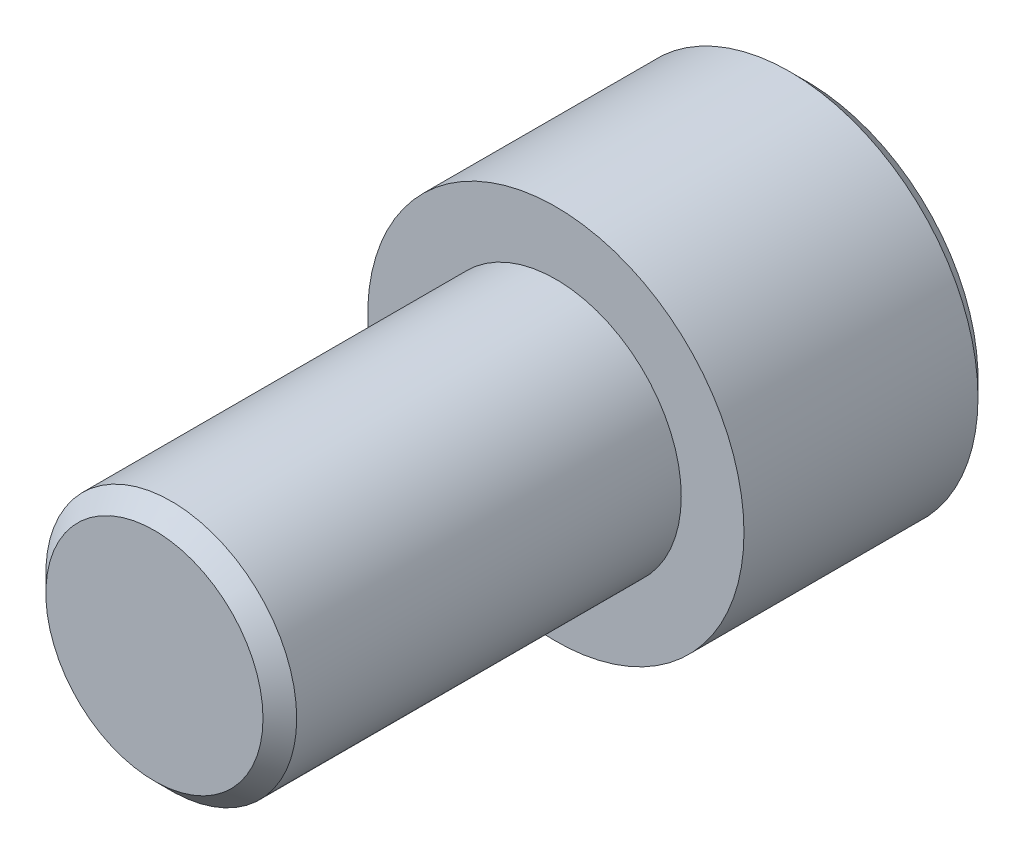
ISO-10303-21;
HEADER;
FILE_DESCRIPTION(('STEP AP214'),'2;1');
FILE_NAME('part.step','',(''),(''),'','','');
FILE_SCHEMA(('AUTOMOTIVE_DESIGN { 1 0 10303 214 1 1 1 1 }'));
ENDSEC;
DATA;
#1=APPLICATION_CONTEXT('core data for automotive mechanical design processes');
#2=APPLICATION_PROTOCOL_DEFINITION('international standard','automotive_design',2000,#1);
#3=PRODUCT_CONTEXT('',#1,'mechanical');
#4=PRODUCT('Part','Part','',(#3));
#5=PRODUCT_RELATED_PRODUCT_CATEGORY('part','',(#4));
#6=PRODUCT_DEFINITION_FORMATION('','',#4);
#7=PRODUCT_DEFINITION_CONTEXT('part definition',#1,'design');
#8=PRODUCT_DEFINITION('design','',#6,#7);
#9=PRODUCT_DEFINITION_SHAPE('','',#8);
#10=(LENGTH_UNIT() NAMED_UNIT(*) SI_UNIT(.MILLI.,.METRE.));
#11=(NAMED_UNIT(*) PLANE_ANGLE_UNIT() SI_UNIT($,.RADIAN.));
#12=(NAMED_UNIT(*) SI_UNIT($,.STERADIAN.) SOLID_ANGLE_UNIT());
#13=UNCERTAINTY_MEASURE_WITH_UNIT(LENGTH_MEASURE(1.E-05),#10,'distance_accuracy_value','');
#14=(GEOMETRIC_REPRESENTATION_CONTEXT(3) GLOBAL_UNCERTAINTY_ASSIGNED_CONTEXT((#13)) GLOBAL_UNIT_ASSIGNED_CONTEXT((#10,
#11,#12)) REPRESENTATION_CONTEXT('',''));
#15=CARTESIAN_POINT('',(0.,0.,0.));
#16=DIRECTION('',(0.,0.,1.));
#17=DIRECTION('',(1.,0.,0.));
#18=AXIS2_PLACEMENT_3D('',#15,#16,#17);
#19=CARTESIAN_POINT('',(0.,0.,12.7));
#20=DIRECTION('',(0.,0.,1.));
#21=DIRECTION('',(1.,0.,0.));
#22=AXIS2_PLACEMENT_3D('',#19,#20,#21);
#23=PLANE('',#22);
#24=CARTESIAN_POINT('',(0.,0.,12.7));
#25=DIRECTION('',(0.,0.,1.));
#26=DIRECTION('',(1.,0.,0.));
#27=AXIS2_PLACEMENT_3D('',#24,#25,#26);
#28=CIRCLE('',#27,3.43535);
#29=CARTESIAN_POINT('',(3.43535,0.,12.7));
#30=VERTEX_POINT('',#29);
#31=EDGE_CURVE('E40',#30,#30,#28,.T.);
#32=ORIENTED_EDGE('',*,*,#31,.T.);
#33=EDGE_LOOP('',(#32));
#34=FACE_BOUND('',#33,.T.);
#35=ADVANCED_FACE('F32',(#34),#23,.T.);
#36=CARTESIAN_POINT('',(0.,0.,12.7));
#37=DIRECTION('',(0.,0.,1.));
#38=DIRECTION('',(1.,0.,0.));
#39=AXIS2_PLACEMENT_3D('',#36,#37,#38);
#40=CYLINDRICAL_SURFACE('',#39,3.96875);
#41=CARTESIAN_POINT('',(0.,0.,12.1666));
#42=DIRECTION('',(0.,0.,1.));
#43=DIRECTION('',(1.,0.,0.));
#44=AXIS2_PLACEMENT_3D('',#41,#42,#43);
#45=CIRCLE('',#44,3.96875);
#46=CARTESIAN_POINT('',(3.96875,0.,12.1666));
#47=VERTEX_POINT('',#46);
#48=EDGE_CURVE('E11',#47,#47,#45,.F.);
#49=ORIENTED_EDGE('',*,*,#48,.T.);
#50=EDGE_LOOP('',(#49));
#51=FACE_BOUND('',#50,.T.);
#52=CARTESIAN_POINT('',(0.,0.,0.));
#53=DIRECTION('',(0.,0.,1.));
#54=DIRECTION('',(1.,0.,0.));
#55=AXIS2_PLACEMENT_3D('',#52,#53,#54);
#56=CIRCLE('',#55,3.96875);
#57=CARTESIAN_POINT('',(3.96875,0.,0.));
#58=VERTEX_POINT('',#57);
#59=EDGE_CURVE('E142',#58,#58,#56,.T.);
#60=ORIENTED_EDGE('',*,*,#59,.T.);
#61=EDGE_LOOP('',(#60));
#62=FACE_BOUND('',#61,.T.);
#63=ADVANCED_FACE('F163',(#51,#62),#40,.T.);
#64=CARTESIAN_POINT('',(3.96875,0.,0.));
#65=DIRECTION('',(0.,0.,1.));
#66=DIRECTION('',(1.,0.,0.));
#67=AXIS2_PLACEMENT_3D('',#64,#65,#66);
#68=PLANE('',#67);
#69=CARTESIAN_POINT('',(0.,0.,0.));
#70=DIRECTION('',(0.,0.,1.));
#71=DIRECTION('',(1.,0.,0.));
#72=AXIS2_PLACEMENT_3D('',#69,#70,#71);
#73=CIRCLE('',#72,5.953125);
#74=CARTESIAN_POINT('',(5.953125,0.,0.));
#75=VERTEX_POINT('',#74);
#76=EDGE_CURVE('E134',#75,#75,#73,.T.);
#77=ORIENTED_EDGE('',*,*,#76,.T.);
#78=EDGE_LOOP('',(#77));
#79=FACE_BOUND('',#78,.T.);
#80=ORIENTED_EDGE('',*,*,#59,.F.);
#81=EDGE_LOOP('',(#80));
#82=FACE_BOUND('',#81,.T.);
#83=ADVANCED_FACE('F168',(#79,#82),#68,.T.);
#84=CARTESIAN_POINT('',(0.,0.,12.7));
#85=DIRECTION('',(0.,0.,1.));
#86=DIRECTION('',(1.,0.,0.));
#87=AXIS2_PLACEMENT_3D('',#84,#85,#86);
#88=CYLINDRICAL_SURFACE('',#87,5.953125);
#89=CARTESIAN_POINT('',(0.,0.,-7.4041));
#90=DIRECTION('',(0.,0.,-1.));
#91=DIRECTION('',(-1.,0.,0.));
#92=AXIS2_PLACEMENT_3D('',#89,#90,#91);
#93=CIRCLE('',#92,5.953125);
#94=CARTESIAN_POINT('',(-5.953125,0.,-7.4041));
#95=VERTEX_POINT('',#94);
#96=EDGE_CURVE('E145',#95,#95,#93,.F.);
#97=ORIENTED_EDGE('',*,*,#96,.T.);
#98=EDGE_LOOP('',(#97));
#99=FACE_BOUND('',#98,.T.);
#100=ORIENTED_EDGE('',*,*,#76,.F.);
#101=EDGE_LOOP('',(#100));
#102=FACE_BOUND('',#101,.T.);
#103=ADVANCED_FACE('F174',(#99,#102),#88,.T.);
#104=CARTESIAN_POINT('',(5.953125,0.,-7.9375));
#105=DIRECTION('',(0.,0.,-1.));
#106=DIRECTION('',(-1.,0.,0.));
#107=AXIS2_PLACEMENT_3D('',#104,#105,#106);
#108=PLANE('',#107);
#109=CARTESIAN_POINT('',(0.,0.,-7.9375));
#110=DIRECTION('',(0.,0.,-1.));
#111=DIRECTION('',(-1.,0.,0.));
#112=AXIS2_PLACEMENT_3D('',#109,#110,#111);
#113=CIRCLE('',#112,5.419725);
#114=CARTESIAN_POINT('',(-5.41972499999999,0.,-7.9375));
#115=VERTEX_POINT('',#114);
#116=EDGE_CURVE('E148',#115,#115,#113,.T.);
#117=ORIENTED_EDGE('',*,*,#116,.T.);
#118=EDGE_LOOP('',(#117));
#119=FACE_BOUND('',#118,.T.);
#120=DIRECTION('',(0.00412520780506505,-0.999991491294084,0.));
#121=VECTOR('',#120,1.);
#122=CARTESIAN_POINT('',(3.16741111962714,1.84616904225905,-7.9375));
#123=LINE('',#122,#121);
#124=CARTESIAN_POINT('',(3.16741111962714,1.84616904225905,-7.9375));
#125=VERTEX_POINT('',#124);
#126=CARTESIAN_POINT('',(3.1825348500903,-1.81997397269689,-7.9375));
#127=VERTEX_POINT('',#126);
#128=EDGE_CURVE('E47',#125,#127,#123,.T.);
#129=ORIENTED_EDGE('',*,*,#128,.F.);
#130=DIRECTION('',(0.868080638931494,-0.496423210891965,0.));
#131=VECTOR('',#130,1.);
#132=CARTESIAN_POINT('',(-0.0151237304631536,3.66614301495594,-7.9375));
#133=LINE('',#132,#131);
#134=CARTESIAN_POINT('',(-0.0151237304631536,3.66614301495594,-7.9375));
#135=VERTEX_POINT('',#134);
#136=EDGE_CURVE('E130',#135,#125,#133,.T.);
#137=ORIENTED_EDGE('',*,*,#136,.F.);
#138=DIRECTION('',(0.863955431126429,0.503568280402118,0.));
#139=VECTOR('',#138,1.);
#140=CARTESIAN_POINT('',(-3.18253485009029,1.81997397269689,-7.9375));
#141=LINE('',#140,#139);
#142=CARTESIAN_POINT('',(-3.18253485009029,1.81997397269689,-7.9375));
#143=VERTEX_POINT('',#142);
#144=EDGE_CURVE('E128',#143,#135,#141,.T.);
#145=ORIENTED_EDGE('',*,*,#144,.F.);
#146=DIRECTION('',(-0.00412520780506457,0.999991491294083,0.));
#147=VECTOR('',#146,1.);
#148=CARTESIAN_POINT('',(-3.16741111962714,-1.84616904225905,-7.9375));
#149=LINE('',#148,#147);
#150=CARTESIAN_POINT('',(-3.16741111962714,-1.84616904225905,-7.9375));
#151=VERTEX_POINT('',#150);
#152=EDGE_CURVE('E95',#151,#143,#149,.T.);
#153=ORIENTED_EDGE('',*,*,#152,.F.);
#154=DIRECTION('',(-0.868080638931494,0.496423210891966,0.));
#155=VECTOR('',#154,1.);
#156=CARTESIAN_POINT('',(0.015123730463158,-3.66614301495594,-7.9375));
#157=LINE('',#156,#155);
#158=CARTESIAN_POINT('',(0.015123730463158,-3.66614301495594,-7.9375));
#159=VERTEX_POINT('',#158);
#160=EDGE_CURVE('E124',#159,#151,#157,.T.);
#161=ORIENTED_EDGE('',*,*,#160,.F.);
#162=DIRECTION('',(-0.863955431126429,-0.503568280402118,0.));
#163=VECTOR('',#162,1.);
#164=CARTESIAN_POINT('',(3.1825348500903,-1.81997397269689,-7.9375));
#165=LINE('',#164,#163);
#166=EDGE_CURVE('E121',#127,#159,#165,.T.);
#167=ORIENTED_EDGE('',*,*,#166,.F.);
#168=EDGE_LOOP('',(#129,#137,#145,#153,#161,#167));
#169=FACE_BOUND('',#168,.T.);
#170=ADVANCED_FACE('F178',(#119,#169),#108,.T.);
#171=CARTESIAN_POINT('',(3.16741111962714,1.84616904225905,-1.5875));
#172=DIRECTION('',(0.999991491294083,0.00412520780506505,0.));
#173=DIRECTION('',(-0.00412520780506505,0.999991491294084,0.));
#174=AXIS2_PLACEMENT_3D('',#171,#172,#173);
#175=PLANE('',#174);
#176=ORIENTED_EDGE('',*,*,#128,.T.);
#177=DIRECTION('',(0.,0.,-1.));
#178=VECTOR('',#177,1.);
#179=CARTESIAN_POINT('',(3.1825348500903,-1.81997397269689,-1.5875));
#180=LINE('',#179,#178);
#181=CARTESIAN_POINT('',(3.1825348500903,-1.81997397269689,-1.5875));
#182=VERTEX_POINT('',#181);
#183=EDGE_CURVE('E77',#182,#127,#180,.T.);
#184=ORIENTED_EDGE('',*,*,#183,.F.);
#185=DIRECTION('',(0.00412520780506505,-0.999991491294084,0.));
#186=VECTOR('',#185,1.);
#187=CARTESIAN_POINT('',(3.16741111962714,1.84616904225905,-1.5875));
#188=LINE('',#187,#186);
#189=CARTESIAN_POINT('',(3.16741111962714,1.84616904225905,-1.5875));
#190=VERTEX_POINT('',#189);
#191=EDGE_CURVE('E132',#190,#182,#188,.T.);
#192=ORIENTED_EDGE('',*,*,#191,.F.);
#193=DIRECTION('',(0.,0.,-1.));
#194=VECTOR('',#193,1.);
#195=CARTESIAN_POINT('',(3.16741111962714,1.84616904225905,-1.5875));
#196=LINE('',#195,#194);
#197=EDGE_CURVE('E55',#190,#125,#196,.T.);
#198=ORIENTED_EDGE('',*,*,#197,.T.);
#199=EDGE_LOOP('',(#176,#184,#192,#198));
#200=FACE_BOUND('',#199,.T.);
#201=ADVANCED_FACE('F182',(#200),#175,.F.);
#202=CARTESIAN_POINT('',(-0.0151237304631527,3.66614301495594,-1.5875));
#203=DIRECTION('',(0.496423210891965,0.868080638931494,0.));
#204=DIRECTION('',(-0.868080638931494,0.496423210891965,0.));
#205=AXIS2_PLACEMENT_3D('',#202,#203,#204);
#206=PLANE('',#205);
#207=ORIENTED_EDGE('',*,*,#136,.T.);
#208=ORIENTED_EDGE('',*,*,#197,.F.);
#209=DIRECTION('',(0.868080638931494,-0.496423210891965,0.));
#210=VECTOR('',#209,1.);
#211=CARTESIAN_POINT('',(-0.0151237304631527,3.66614301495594,-1.5875));
#212=LINE('',#211,#210);
#213=CARTESIAN_POINT('',(-0.0151237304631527,3.66614301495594,-1.5875));
#214=VERTEX_POINT('',#213);
#215=EDGE_CURVE('E107',#214,#190,#212,.T.);
#216=ORIENTED_EDGE('',*,*,#215,.F.);
#217=DIRECTION('',(0.,0.,-1.));
#218=VECTOR('',#217,1.);
#219=CARTESIAN_POINT('',(-0.0151237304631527,3.66614301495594,-1.5875));
#220=LINE('',#219,#218);
#221=EDGE_CURVE('E99',#214,#135,#220,.T.);
#222=ORIENTED_EDGE('',*,*,#221,.T.);
#223=EDGE_LOOP('',(#207,#208,#216,#222));
#224=FACE_BOUND('',#223,.T.);
#225=ADVANCED_FACE('F186',(#224),#206,.F.);
#226=CARTESIAN_POINT('',(-3.18253485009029,1.81997397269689,-1.5875));
#227=DIRECTION('',(-0.503568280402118,0.863955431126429,0.));
#228=DIRECTION('',(-0.863955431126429,-0.503568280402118,0.));
#229=AXIS2_PLACEMENT_3D('',#226,#227,#228);
#230=PLANE('',#229);
#231=ORIENTED_EDGE('',*,*,#144,.T.);
#232=ORIENTED_EDGE('',*,*,#221,.F.);
#233=DIRECTION('',(0.863955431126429,0.503568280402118,0.));
#234=VECTOR('',#233,1.);
#235=CARTESIAN_POINT('',(-3.18253485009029,1.81997397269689,-1.5875));
#236=LINE('',#235,#234);
#237=CARTESIAN_POINT('',(-3.18253485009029,1.81997397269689,-1.5875));
#238=VERTEX_POINT('',#237);
#239=EDGE_CURVE('E103',#238,#214,#236,.T.);
#240=ORIENTED_EDGE('',*,*,#239,.F.);
#241=DIRECTION('',(0.,0.,-1.));
#242=VECTOR('',#241,1.);
#243=CARTESIAN_POINT('',(-3.18253485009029,1.81997397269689,-1.5875));
#244=LINE('',#243,#242);
#245=EDGE_CURVE('E88',#238,#143,#244,.T.);
#246=ORIENTED_EDGE('',*,*,#245,.T.);
#247=EDGE_LOOP('',(#231,#232,#240,#246));
#248=FACE_BOUND('',#247,.T.);
#249=ADVANCED_FACE('F104',(#248),#230,.F.);
#250=CARTESIAN_POINT('',(-3.16741111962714,-1.84616904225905,-1.5875));
#251=DIRECTION('',(-0.999991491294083,-0.00412520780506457,0.));
#252=DIRECTION('',(0.00412520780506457,-0.999991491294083,0.));
#253=AXIS2_PLACEMENT_3D('',#250,#251,#252);
#254=PLANE('',#253);
#255=ORIENTED_EDGE('',*,*,#152,.T.);
#256=ORIENTED_EDGE('',*,*,#245,.F.);
#257=DIRECTION('',(-0.00412520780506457,0.999991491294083,0.));
#258=VECTOR('',#257,1.);
#259=CARTESIAN_POINT('',(-3.16741111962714,-1.84616904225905,-1.5875));
#260=LINE('',#259,#258);
#261=CARTESIAN_POINT('',(-3.16741111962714,-1.84616904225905,-1.5875));
#262=VERTEX_POINT('',#261);
#263=EDGE_CURVE('E92',#262,#238,#260,.T.);
#264=ORIENTED_EDGE('',*,*,#263,.F.);
#265=DIRECTION('',(0.,0.,-1.));
#266=VECTOR('',#265,1.);
#267=CARTESIAN_POINT('',(-3.16741111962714,-1.84616904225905,-1.5875));
#268=LINE('',#267,#266);
#269=EDGE_CURVE('E100',#262,#151,#268,.T.);
#270=ORIENTED_EDGE('',*,*,#269,.T.);
#271=EDGE_LOOP('',(#255,#256,#264,#270));
#272=FACE_BOUND('',#271,.T.);
#273=ADVANCED_FACE('F90',(#272),#254,.F.);
#274=CARTESIAN_POINT('',(0.015123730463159,-3.66614301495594,-1.5875));
#275=DIRECTION('',(-0.496423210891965,-0.868080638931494,0.));
#276=DIRECTION('',(0.868080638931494,-0.496423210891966,0.));
#277=AXIS2_PLACEMENT_3D('',#274,#275,#276);
#278=PLANE('',#277);
#279=ORIENTED_EDGE('',*,*,#160,.T.);
#280=ORIENTED_EDGE('',*,*,#269,.F.);
#281=DIRECTION('',(-0.868080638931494,0.496423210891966,0.));
#282=VECTOR('',#281,1.);
#283=CARTESIAN_POINT('',(0.015123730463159,-3.66614301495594,-1.5875));
#284=LINE('',#283,#282);
#285=CARTESIAN_POINT('',(0.015123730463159,-3.66614301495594,-1.5875));
#286=VERTEX_POINT('',#285);
#287=EDGE_CURVE('E113',#286,#262,#284,.T.);
#288=ORIENTED_EDGE('',*,*,#287,.F.);
#289=DIRECTION('',(0.,0.,-1.));
#290=VECTOR('',#289,1.);
#291=CARTESIAN_POINT('',(0.015123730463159,-3.66614301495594,-1.5875));
#292=LINE('',#291,#290);
#293=EDGE_CURVE('E137',#286,#159,#292,.T.);
#294=ORIENTED_EDGE('',*,*,#293,.T.);
#295=EDGE_LOOP('',(#279,#280,#288,#294));
#296=FACE_BOUND('',#295,.T.);
#297=ADVANCED_FACE('F190',(#296),#278,.F.);
#298=CARTESIAN_POINT('',(3.1825348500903,-1.81997397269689,-1.5875));
#299=DIRECTION('',(0.503568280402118,-0.863955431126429,0.));
#300=DIRECTION('',(0.863955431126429,0.503568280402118,0.));
#301=AXIS2_PLACEMENT_3D('',#298,#299,#300);
#302=PLANE('',#301);
#303=ORIENTED_EDGE('',*,*,#166,.T.);
#304=ORIENTED_EDGE('',*,*,#293,.F.);
#305=DIRECTION('',(-0.863955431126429,-0.503568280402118,0.));
#306=VECTOR('',#305,1.);
#307=CARTESIAN_POINT('',(3.1825348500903,-1.81997397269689,-1.5875));
#308=LINE('',#307,#306);
#309=EDGE_CURVE('E115',#182,#286,#308,.T.);
#310=ORIENTED_EDGE('',*,*,#309,.F.);
#311=ORIENTED_EDGE('',*,*,#183,.T.);
#312=EDGE_LOOP('',(#303,#304,#310,#311));
#313=FACE_BOUND('',#312,.T.);
#314=ADVANCED_FACE('F187',(#313),#302,.F.);
#315=CARTESIAN_POINT('',(3.16741111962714,1.84616904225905,-1.5875));
#316=DIRECTION('',(0.,0.,1.));
#317=DIRECTION('',(1.,0.,0.));
#318=AXIS2_PLACEMENT_3D('',#315,#316,#317);
#319=PLANE('',#318);
#320=ORIENTED_EDGE('',*,*,#191,.T.);
#321=ORIENTED_EDGE('',*,*,#309,.T.);
#322=ORIENTED_EDGE('',*,*,#287,.T.);
#323=ORIENTED_EDGE('',*,*,#263,.T.);
#324=ORIENTED_EDGE('',*,*,#239,.T.);
#325=ORIENTED_EDGE('',*,*,#215,.T.);
#326=EDGE_LOOP('',(#320,#321,#322,#323,#324,#325));
#327=FACE_BOUND('',#326,.T.);
#328=ADVANCED_FACE('F110',(#327),#319,.F.);
#329=CARTESIAN_POINT('',(0.,0.,-7.4041));
#330=DIRECTION('',(0.,0.,1.));
#331=DIRECTION('',(1.,0.,0.));
#332=AXIS2_PLACEMENT_3D('',#329,#330,#331);
#333=CONICAL_SURFACE('',#332,5.953125,0.78539816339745);
#334=ORIENTED_EDGE('',*,*,#116,.F.);
#335=EDGE_LOOP('',(#334));
#336=FACE_BOUND('',#335,.T.);
#337=ORIENTED_EDGE('',*,*,#96,.F.);
#338=EDGE_LOOP('',(#337));
#339=FACE_BOUND('',#338,.T.);
#340=ADVANCED_FACE('F155',(#336,#339),#333,.T.);
#341=CARTESIAN_POINT('',(0.,0.,12.7));
#342=DIRECTION('',(0.,0.,-1.));
#343=DIRECTION('',(-1.,0.,0.));
#344=AXIS2_PLACEMENT_3D('',#341,#342,#343);
#345=CONICAL_SURFACE('',#344,3.43535,0.785398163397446);
#346=ORIENTED_EDGE('',*,*,#48,.F.);
#347=EDGE_LOOP('',(#346));
#348=FACE_BOUND('',#347,.T.);
#349=ORIENTED_EDGE('',*,*,#31,.F.);
#350=EDGE_LOOP('',(#349));
#351=FACE_BOUND('',#350,.T.);
#352=ADVANCED_FACE('F34',(#348,#351),#345,.T.);
#353=CLOSED_SHELL('',(#35,#63,#83,#103,#170,#201,#225,#249,#273,#297,#314,#328,#340,#352));
#354=MANIFOLD_SOLID_BREP('B2',#353);
#355=ADVANCED_BREP_SHAPE_REPRESENTATION('',(#18,#354),#14);
#356=SHAPE_DEFINITION_REPRESENTATION(#9,#355);
ENDSEC;
END-ISO-10303-21;
